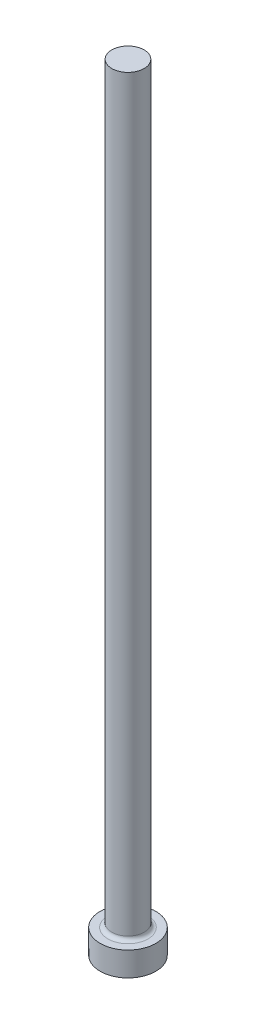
ISO-10303-21;
HEADER;
FILE_DESCRIPTION(('STEP AP214'),'2;1');
FILE_NAME('part.step','',(''),(''),'','','');
FILE_SCHEMA(('AUTOMOTIVE_DESIGN { 1 0 10303 214 1 1 1 1 }'));
ENDSEC;
DATA;
#1=APPLICATION_CONTEXT('core data for automotive mechanical design processes');
#2=APPLICATION_PROTOCOL_DEFINITION('international standard','automotive_design',2000,#1);
#3=PRODUCT_CONTEXT('',#1,'mechanical');
#4=PRODUCT('Part','Part','',(#3));
#5=PRODUCT_RELATED_PRODUCT_CATEGORY('part','',(#4));
#6=PRODUCT_DEFINITION_FORMATION('','',#4);
#7=PRODUCT_DEFINITION_CONTEXT('part definition',#1,'design');
#8=PRODUCT_DEFINITION('design','',#6,#7);
#9=PRODUCT_DEFINITION_SHAPE('','',#8);
#10=(LENGTH_UNIT() NAMED_UNIT(*) SI_UNIT(.MILLI.,.METRE.));
#11=(NAMED_UNIT(*) PLANE_ANGLE_UNIT() SI_UNIT($,.RADIAN.));
#12=(NAMED_UNIT(*) SI_UNIT($,.STERADIAN.) SOLID_ANGLE_UNIT());
#13=UNCERTAINTY_MEASURE_WITH_UNIT(LENGTH_MEASURE(1.E-05),#10,'distance_accuracy_value','');
#14=(GEOMETRIC_REPRESENTATION_CONTEXT(3) GLOBAL_UNCERTAINTY_ASSIGNED_CONTEXT((#13)) GLOBAL_UNIT_ASSIGNED_CONTEXT((#10,
#11,#12)) REPRESENTATION_CONTEXT('',''));
#15=CARTESIAN_POINT('',(0.,0.,0.));
#16=DIRECTION('',(0.,0.,1.));
#17=DIRECTION('',(1.,0.,0.));
#18=AXIS2_PLACEMENT_3D('',#15,#16,#17);
#19=CARTESIAN_POINT('',(3.175,152.4,0.));
#20=DIRECTION('',(0.,-1.,0.));
#21=DIRECTION('',(1.,0.,0.));
#22=AXIS2_PLACEMENT_3D('',#19,#20,#21);
#23=PLANE('',#22);
#24=CARTESIAN_POINT('',(0.,152.4,0.));
#25=DIRECTION('',(0.,1.,0.));
#26=DIRECTION('',(-1.,0.,0.));
#27=AXIS2_PLACEMENT_3D('',#24,#25,#26);
#28=CIRCLE('',#27,3.17499999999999);
#29=CARTESIAN_POINT('',(-3.17499999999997,152.4,0.));
#30=VERTEX_POINT('',#29);
#31=EDGE_CURVE('E10',#30,#30,#28,.T.);
#32=ORIENTED_EDGE('',*,*,#31,.T.);
#33=EDGE_LOOP('',(#32));
#34=FACE_BOUND('',#33,.T.);
#35=ADVANCED_FACE('F30',(#34),#23,.F.);
#36=CARTESIAN_POINT('',(0.,152.4,0.));
#37=DIRECTION('',(0.,1.,0.));
#38=DIRECTION('',(-1.,0.,0.));
#39=AXIS2_PLACEMENT_3D('',#36,#37,#38);
#40=CYLINDRICAL_SURFACE('',#39,3.17499999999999);
#41=ORIENTED_EDGE('',*,*,#31,.F.);
#42=EDGE_LOOP('',(#41));
#43=FACE_BOUND('',#42,.T.);
#44=CARTESIAN_POINT('',(0.,5.51180000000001,0.));
#45=DIRECTION('',(0.,1.,0.));
#46=DIRECTION('',(-1.,0.,0.));
#47=AXIS2_PLACEMENT_3D('',#44,#45,#46);
#48=CIRCLE('',#47,3.175);
#49=CARTESIAN_POINT('',(-3.175,5.51180000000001,0.));
#50=VERTEX_POINT('',#49);
#51=EDGE_CURVE('E36',#50,#50,#48,.T.);
#52=ORIENTED_EDGE('',*,*,#51,.T.);
#53=EDGE_LOOP('',(#52));
#54=FACE_BOUND('',#53,.T.);
#55=ADVANCED_FACE('F65',(#43,#54),#40,.T.);
#56=CARTESIAN_POINT('',(0.,5.5118,0.));
#57=DIRECTION('',(0.,1.,0.));
#58=DIRECTION('',(-1.,0.,0.));
#59=AXIS2_PLACEMENT_3D('',#56,#57,#58);
#60=TOROIDAL_SURFACE('',#59,3.937,0.762);
#61=ORIENTED_EDGE('',*,*,#51,.F.);
#62=EDGE_LOOP('',(#61));
#63=FACE_BOUND('',#62,.T.);
#64=CARTESIAN_POINT('',(0.,4.7498,0.));
#65=DIRECTION('',(0.,1.,0.));
#66=DIRECTION('',(-1.,0.,0.));
#67=AXIS2_PLACEMENT_3D('',#64,#65,#66);
#68=CIRCLE('',#67,3.937);
#69=CARTESIAN_POINT('',(-3.937,4.7498,0.));
#70=VERTEX_POINT('',#69);
#71=EDGE_CURVE('E40',#70,#70,#68,.T.);
#72=ORIENTED_EDGE('',*,*,#71,.T.);
#73=EDGE_LOOP('',(#72));
#74=FACE_BOUND('',#73,.T.);
#75=ADVANCED_FACE('F69',(#63,#74),#60,.F.);
#76=CARTESIAN_POINT('',(5.461,4.7498,0.));
#77=DIRECTION('',(0.,-1.,0.));
#78=DIRECTION('',(1.,0.,0.));
#79=AXIS2_PLACEMENT_3D('',#76,#77,#78);
#80=PLANE('',#79);
#81=ORIENTED_EDGE('',*,*,#71,.F.);
#82=EDGE_LOOP('',(#81));
#83=FACE_BOUND('',#82,.T.);
#84=CARTESIAN_POINT('',(0.,4.7498,0.));
#85=DIRECTION('',(0.,1.,0.));
#86=DIRECTION('',(-1.,0.,0.));
#87=AXIS2_PLACEMENT_3D('',#84,#85,#86);
#88=CIRCLE('',#87,5.461);
#89=CARTESIAN_POINT('',(-5.461,4.7498,0.));
#90=VERTEX_POINT('',#89);
#91=EDGE_CURVE('E44',#90,#90,#88,.T.);
#92=ORIENTED_EDGE('',*,*,#91,.T.);
#93=EDGE_LOOP('',(#92));
#94=FACE_BOUND('',#93,.T.);
#95=ADVANCED_FACE('F61',(#83,#94),#80,.F.);
#96=CARTESIAN_POINT('',(0.,152.4,0.));
#97=DIRECTION('',(0.,1.,0.));
#98=DIRECTION('',(-1.,0.,0.));
#99=AXIS2_PLACEMENT_3D('',#96,#97,#98);
#100=CYLINDRICAL_SURFACE('',#99,5.461);
#101=ORIENTED_EDGE('',*,*,#91,.F.);
#102=EDGE_LOOP('',(#101));
#103=FACE_BOUND('',#102,.T.);
#104=CARTESIAN_POINT('',(0.,0.,0.));
#105=DIRECTION('',(0.,1.,0.));
#106=DIRECTION('',(-1.,0.,0.));
#107=AXIS2_PLACEMENT_3D('',#104,#105,#106);
#108=CIRCLE('',#107,5.461);
#109=CARTESIAN_POINT('',(-5.461,0.,0.));
#110=VERTEX_POINT('',#109);
#111=EDGE_CURVE('E49',#110,#110,#108,.T.);
#112=ORIENTED_EDGE('',*,*,#111,.T.);
#113=EDGE_LOOP('',(#112));
#114=FACE_BOUND('',#113,.T.);
#115=ADVANCED_FACE('F53',(#103,#114),#100,.T.);
#116=CARTESIAN_POINT('',(0.,0.,0.));
#117=DIRECTION('',(0.,1.,0.));
#118=DIRECTION('',(-1.,0.,0.));
#119=AXIS2_PLACEMENT_3D('',#116,#117,#118);
#120=PLANE('',#119);
#121=ORIENTED_EDGE('',*,*,#111,.F.);
#122=EDGE_LOOP('',(#121));
#123=FACE_BOUND('',#122,.T.);
#124=ADVANCED_FACE('F55',(#123),#120,.F.);
#125=CLOSED_SHELL('',(#35,#55,#75,#95,#115,#124));
#126=MANIFOLD_SOLID_BREP('B2',#125);
#127=ADVANCED_BREP_SHAPE_REPRESENTATION('',(#18,#126),#14);
#128=SHAPE_DEFINITION_REPRESENTATION(#9,#127);
ENDSEC;
END-ISO-10303-21;
